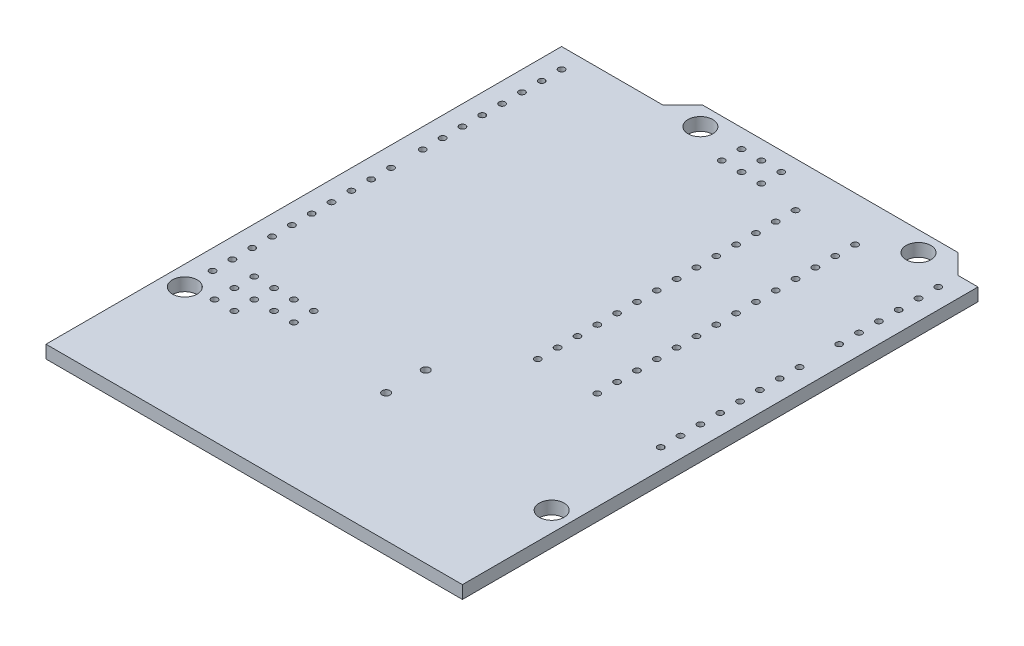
from build123d import *

# Parameters (mm, degrees)
SKETCH1_R           = 1.5875
BOSS_EXTRUDE1_DEPTH = 1.65
SKETCH2_R           = 0.4
CUT_EXTRUDE1_DEPTH  = 1.65
SKETCH3_R           = 0.4
CUT_EXTRUDE2_DEPTH  = 1.65
LPATTERN1_COUNT     = 15
LPATTERN1_PITCH     = 2.54
SKETCH4_R           = 0.4
CUT_EXTRUDE3_DEPTH  = 1.65
LPATTERN2_COUNT     = 10
LPATTERN2_PITCH     = 2.54
LPATTERN3_COUNT     = 8
LPATTERN3_PITCH     = 2.54
SKETCH5_R           = 0.4
SKETCH5_R_2         = 0.5
CUT_EXTRUDE4_DEPTH  = 10
SKETCH6_R           = 0.4
CUT_EXTRUDE5_DEPTH  = 10


with BuildPart() as part:
    # Sketch1 → Boss-Extrude1 (new body)
    with BuildSketch(Plane(origin=(0, 0, 0), x_dir=(1, 0, 0), z_dir=(0, 1, 0))):
        Polygon((0, 0), (-53.34, 0), (-53.34, 66.04), (-40.386, 66.04), (-37.846, 68.58), (-5.08, 68.58), (-2.54, 66.04), (0, 66.04), align=None)
        with Locations(Location((-7.62, 66.04, 0), (0, 0, 270))):
            Circle(SKETCH1_R, mode=Mode.SUBTRACT)
        with Locations(Location((-35.56, 66.04, 0), (0, 0, 270))):
            Circle(SKETCH1_R, mode=Mode.SUBTRACT)
        with Locations(Location((-2.54, 13.97, 0), (0, 0, 270))):
            Circle(SKETCH1_R, mode=Mode.SUBTRACT)
        with Locations(Location((-50.8, 15.24, 0), (0, 0, 270))):
            Circle(SKETCH1_R, mode=Mode.SUBTRACT)
    extrude(amount=-BOSS_EXTRUDE1_DEPTH)

    # Sketch2 → Cut-Extrude1 (cut)
    with BuildSketch(Plane(origin=(0, 0, 0), x_dir=(1, 0, 0), z_dir=(0, 1, 0))):
        with Locations(Location((-2.54, 27.94, 0), (0, 0, 270))):
            Circle(SKETCH2_R)
    cut_extrude1 = extrude(amount=-CUT_EXTRUDE1_DEPTH, mode=Mode.SUBTRACT)

    # Sketch3 → Cut-Extrude2 (cut)
    with BuildSketch(Plane(origin=(0, 0, 0), x_dir=(1, 0, 0), z_dir=(0, 1, 0))):
        with Locations(Location((-50.8, 18.796, 0), (0, 0, 270))):
            Circle(SKETCH3_R)
    cut_extrude2 = extrude(amount=-CUT_EXTRUDE2_DEPTH, mode=Mode.SUBTRACT)

    # LPattern1: Cut-Extrude1 ×15, 1 skipped
    with Locations(*[(0, 0, -i * LPATTERN1_PITCH) for i in range(1, LPATTERN1_COUNT) if i not in (8,)]):
        add(cut_extrude1, mode=Mode.SUBTRACT)

    # Sketch4 → Cut-Extrude3 (cut)
    with BuildSketch(Plane(origin=(0, 0, 0), x_dir=(1, 0, 0), z_dir=(0, 1, 0))):
        with Locations(Location((-50.8, 45.72, 0), (0, 0, 270))):
            Circle(SKETCH4_R)
    cut_extrude3 = extrude(amount=-CUT_EXTRUDE3_DEPTH, mode=Mode.SUBTRACT)

    # LPattern2: Cut-Extrude2 ×10
    with Locations(*[(0, 0, -i * LPATTERN2_PITCH) for i in range(1, LPATTERN2_COUNT)]):
        add(cut_extrude2, mode=Mode.SUBTRACT)

    # LPattern3: Cut-Extrude3 ×8
    with Locations(*[(0, 0, -i * LPATTERN3_PITCH) for i in range(1, LPATTERN3_COUNT)]):
        add(cut_extrude3, mode=Mode.SUBTRACT)

    # Sketch5 → Cut-Extrude4 (cut)
    with BuildSketch(Plane(origin=(0, 0, 0), x_dir=(1, 0, 0), z_dir=(0, 1, 0))):
        with Locations(Location((-30.43, 66.18, 0), (0, 0, 270))):
            Circle(SKETCH5_R)
        with Locations(Location((-27.89, 66.18, 0), (0, 0, 270))):
            Circle(SKETCH5_R)
        with Locations(Location((-25.35, 66.18, 0), (0, 0, 270))):
            Circle(SKETCH5_R)
        with Locations(Location((-25.35, 63.64, 0), (0, 0, 270))):
            Circle(SKETCH5_R)
        with Locations(Location((-27.89, 63.64, 0), (0, 0, 270))):
            Circle(SKETCH5_R)
        with Locations(Location((-30.43, 63.64, 0), (0, 0, 270))):
            Circle(SKETCH5_R)
        with Locations(Location((-47.498, 15.748, 0), (0, 0, 270))):
            Circle(SKETCH5_R)
        with Locations(Location((-47.498, 18.288, 0), (0, 0, 270))):
            Circle(SKETCH5_R)
        with Locations(Location((-47.498, 20.828, 0), (0, 0, 270))):
            Circle(SKETCH5_R)
        with Locations(Location((-44.958, 20.828, 0), (0, 0, 270))):
            Circle(SKETCH5_R)
        with Locations(Location((-44.958, 18.288, 0), (0, 0, 270))):
            Circle(SKETCH5_R)
        with Locations(Location((-44.958, 15.748, 0), (0, 0, 270))):
            Circle(SKETCH5_R)
        with Locations(Location((-42.418, 18.288, 0), (0, 0, 270))):
            Circle(SKETCH5_R)
        with Locations(Location((-42.418, 20.828, 0), (0, 0, 270))):
            Circle(SKETCH5_R)
        with Locations(Location((-39.878, 20.828, 0), (0, 0, 270))):
            Circle(SKETCH5_R)
        with Locations(Location((-39.878, 18.288, 0), (0, 0, 270))):
            Circle(SKETCH5_R)
        with Locations(Location((-26.162, 21.463, 0), (0, 0, 270))):
            Circle(SKETCH5_R_2)
        with Locations(Location((-26.162, 16.383, 0), (0, 0, 270))):
            Circle(SKETCH5_R_2)
    extrude(amount=-CUT_EXTRUDE4_DEPTH, mode=Mode.SUBTRACT)

    # Sketch6 → Cut-Extrude5 (cut)
    with BuildSketch(Plane(origin=(0, 0, 0), x_dir=(1, 0, 0), z_dir=(0, 1, 0))):
        with Locations(Location((-20.193, 29.845, 0), (0, 0, 270))):
            Circle(SKETCH6_R)
        with Locations(Location((-12.573, 29.845, 0), (0, 0, 270))):
            Circle(SKETCH6_R)
        with Locations(Location((-20.193, 32.385, 0), (0, 0, 270))):
            Circle(SKETCH6_R)
        with Locations(Location((-12.573, 32.385, 0), (0, 0, 270))):
            Circle(SKETCH6_R)
        with Locations(Location((-20.193, 34.925, 0), (0, 0, 270))):
            Circle(SKETCH6_R)
        with Locations(Location((-12.573, 34.925, 0), (0, 0, 270))):
            Circle(SKETCH6_R)
        with Locations(Location((-20.193, 37.465, 0), (0, 0, 270))):
            Circle(SKETCH6_R)
        with Locations(Location((-12.573, 37.465, 0), (0, 0, 270))):
            Circle(SKETCH6_R)
        with Locations(Location((-20.193, 40.005, 0), (0, 0, 270))):
            Circle(SKETCH6_R)
        with Locations(Location((-12.573, 40.005, 0), (0, 0, 270))):
            Circle(SKETCH6_R)
        with Locations(Location((-20.193, 42.545, 0), (0, 0, 270))):
            Circle(SKETCH6_R)
        with Locations(Location((-12.573, 42.545, 0), (0, 0, 270))):
            Circle(SKETCH6_R)
        with Locations(Location((-20.193, 45.085, 0), (0, 0, 270))):
            Circle(SKETCH6_R)
        with Locations(Location((-12.573, 45.085, 0), (0, 0, 270))):
            Circle(SKETCH6_R)
        with Locations(Location((-20.193, 47.625, 0), (0, 0, 270))):
            Circle(SKETCH6_R)
        with Locations(Location((-12.573, 47.625, 0), (0, 0, 270))):
            Circle(SKETCH6_R)
        with Locations(Location((-20.193, 50.165, 0), (0, 0, 270))):
            Circle(SKETCH6_R)
        with Locations(Location((-12.573, 50.165, 0), (0, 0, 270))):
            Circle(SKETCH6_R)
        with Locations(Location((-20.193, 52.705, 0), (0, 0, 270))):
            Circle(SKETCH6_R)
        with Locations(Location((-12.573, 52.705, 0), (0, 0, 270))):
            Circle(SKETCH6_R)
        with Locations(Location((-20.193, 55.245, 0), (0, 0, 270))):
            Circle(SKETCH6_R)
        with Locations(Location((-12.573, 55.245, 0), (0, 0, 270))):
            Circle(SKETCH6_R)
        with Locations(Location((-20.193, 57.785, 0), (0, 0, 270))):
            Circle(SKETCH6_R)
        with Locations(Location((-12.573, 57.785, 0), (0, 0, 270))):
            Circle(SKETCH6_R)
        with Locations(Location((-20.193, 60.325, 0), (0, 0, 270))):
            Circle(SKETCH6_R)
        with Locations(Location((-12.573, 60.325, 0), (0, 0, 270))):
            Circle(SKETCH6_R)
        with Locations(Location((-20.193, 62.865, 0), (0, 0, 270))):
            Circle(SKETCH6_R)
        with Locations(Location((-12.573, 62.865, 0), (0, 0, 270))):
            Circle(SKETCH6_R)
    extrude(amount=-CUT_EXTRUDE5_DEPTH, mode=Mode.SUBTRACT)


solid = part.part
